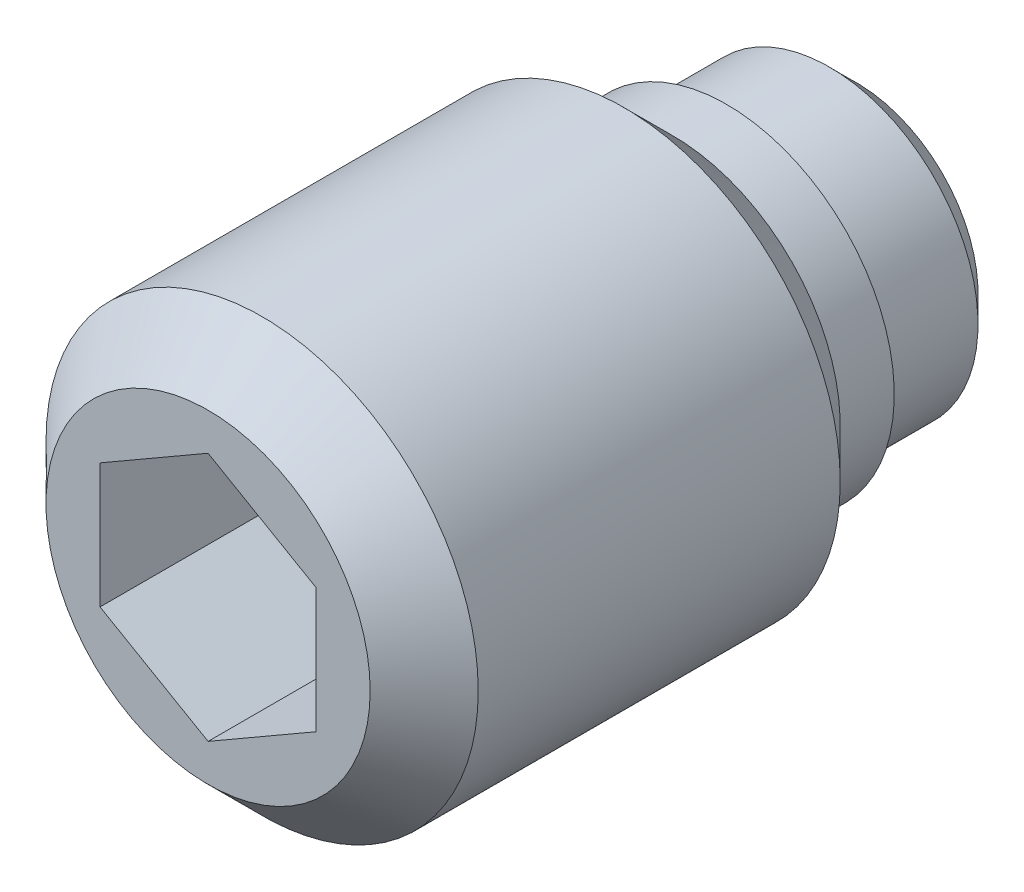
ISO-10303-21;
HEADER;
FILE_DESCRIPTION(('STEP AP214'),'2;1');
FILE_NAME('part.step','',(''),(''),'','','');
FILE_SCHEMA(('AUTOMOTIVE_DESIGN { 1 0 10303 214 1 1 1 1 }'));
ENDSEC;
DATA;
#1=APPLICATION_CONTEXT('core data for automotive mechanical design processes');
#2=APPLICATION_PROTOCOL_DEFINITION('international standard','automotive_design',2000,#1);
#3=PRODUCT_CONTEXT('',#1,'mechanical');
#4=PRODUCT('Part','Part','',(#3));
#5=PRODUCT_RELATED_PRODUCT_CATEGORY('part','',(#4));
#6=PRODUCT_DEFINITION_FORMATION('','',#4);
#7=PRODUCT_DEFINITION_CONTEXT('part definition',#1,'design');
#8=PRODUCT_DEFINITION('design','',#6,#7);
#9=PRODUCT_DEFINITION_SHAPE('','',#8);
#10=(LENGTH_UNIT() NAMED_UNIT(*) SI_UNIT(.MILLI.,.METRE.));
#11=(NAMED_UNIT(*) PLANE_ANGLE_UNIT() SI_UNIT($,.RADIAN.));
#12=(NAMED_UNIT(*) SI_UNIT($,.STERADIAN.) SOLID_ANGLE_UNIT());
#13=UNCERTAINTY_MEASURE_WITH_UNIT(LENGTH_MEASURE(1.E-05),#10,'distance_accuracy_value','');
#14=(GEOMETRIC_REPRESENTATION_CONTEXT(3) GLOBAL_UNCERTAINTY_ASSIGNED_CONTEXT((#13)) GLOBAL_UNIT_ASSIGNED_CONTEXT((#10,
#11,#12)) REPRESENTATION_CONTEXT('',''));
#15=CARTESIAN_POINT('',(0.,0.,0.));
#16=DIRECTION('',(0.,0.,1.));
#17=DIRECTION('',(1.,0.,0.));
#18=AXIS2_PLACEMENT_3D('',#15,#16,#17);
#19=CARTESIAN_POINT('',(0.,0.,2.4));
#20=DIRECTION('',(0.,0.,-1.));
#21=DIRECTION('',(-1.,0.,0.));
#22=AXIS2_PLACEMENT_3D('',#19,#20,#21);
#23=CYLINDRICAL_SURFACE('',#22,4.);
#24=CARTESIAN_POINT('',(0.,0.,4.3));
#25=DIRECTION('',(0.,0.,-1.));
#26=DIRECTION('',(-1.,0.,0.));
#27=AXIS2_PLACEMENT_3D('',#24,#25,#26);
#28=CIRCLE('',#27,4.);
#29=CARTESIAN_POINT('',(-4.,0.,4.3));
#30=VERTEX_POINT('',#29);
#31=EDGE_CURVE('E9',#30,#30,#28,.T.);
#32=ORIENTED_EDGE('',*,*,#31,.F.);
#33=EDGE_LOOP('',(#32));
#34=FACE_BOUND('',#33,.T.);
#35=CARTESIAN_POINT('',(0.,0.,11.));
#36=DIRECTION('',(0.,0.,1.));
#37=DIRECTION('',(1.,0.,0.));
#38=AXIS2_PLACEMENT_3D('',#35,#36,#37);
#39=CIRCLE('',#38,4.);
#40=CARTESIAN_POINT('',(4.,0.,11.));
#41=VERTEX_POINT('',#40);
#42=EDGE_CURVE('E115',#41,#41,#39,.T.);
#43=ORIENTED_EDGE('',*,*,#42,.F.);
#44=EDGE_LOOP('',(#43));
#45=FACE_BOUND('',#44,.T.);
#46=ADVANCED_FACE('F14',(#34,#45),#23,.T.);
#47=CARTESIAN_POINT('',(0.,0.,4.3));
#48=DIRECTION('',(0.,0.,1.));
#49=DIRECTION('',(1.,0.,0.));
#50=AXIS2_PLACEMENT_3D('',#47,#48,#49);
#51=CONICAL_SURFACE('',#50,4.,0.785398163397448);
#52=ORIENTED_EDGE('',*,*,#31,.T.);
#53=EDGE_LOOP('',(#52));
#54=FACE_BOUND('',#53,.T.);
#55=CARTESIAN_POINT('',(0.,0.,3.4));
#56=DIRECTION('',(0.,0.,-1.));
#57=DIRECTION('',(-1.,0.,0.));
#58=AXIS2_PLACEMENT_3D('',#55,#56,#57);
#59=CIRCLE('',#58,3.1);
#60=CARTESIAN_POINT('',(-3.1,0.,3.4));
#61=VERTEX_POINT('',#60);
#62=EDGE_CURVE('E21',#61,#61,#59,.T.);
#63=ORIENTED_EDGE('',*,*,#62,.F.);
#64=EDGE_LOOP('',(#63));
#65=FACE_BOUND('',#64,.T.);
#66=ADVANCED_FACE('F143',(#54,#65),#51,.T.);
#67=CARTESIAN_POINT('',(0.,0.,2.4));
#68=DIRECTION('',(0.,0.,-1.));
#69=DIRECTION('',(-1.,0.,0.));
#70=AXIS2_PLACEMENT_3D('',#67,#68,#69);
#71=CYLINDRICAL_SURFACE('',#70,3.1);
#72=ORIENTED_EDGE('',*,*,#62,.T.);
#73=EDGE_LOOP('',(#72));
#74=FACE_BOUND('',#73,.T.);
#75=CARTESIAN_POINT('',(0.,0.,2.4));
#76=DIRECTION('',(0.,0.,-1.));
#77=DIRECTION('',(-1.,0.,0.));
#78=AXIS2_PLACEMENT_3D('',#75,#76,#77);
#79=CIRCLE('',#78,3.1);
#80=CARTESIAN_POINT('',(-3.1,0.,2.4));
#81=VERTEX_POINT('',#80);
#82=EDGE_CURVE('E135',#81,#81,#79,.T.);
#83=ORIENTED_EDGE('',*,*,#82,.F.);
#84=EDGE_LOOP('',(#83));
#85=FACE_BOUND('',#84,.T.);
#86=ADVANCED_FACE('F140',(#74,#85),#71,.T.);
#87=CARTESIAN_POINT('',(0.,3.1,2.4));
#88=DIRECTION('',(0.,0.,1.));
#89=DIRECTION('',(1.,0.,0.));
#90=AXIS2_PLACEMENT_3D('',#87,#88,#89);
#91=PLANE('',#90);
#92=ORIENTED_EDGE('',*,*,#82,.T.);
#93=EDGE_LOOP('',(#92));
#94=FACE_BOUND('',#93,.T.);
#95=CARTESIAN_POINT('',(0.,0.,2.4));
#96=DIRECTION('',(0.,0.,-1.));
#97=DIRECTION('',(-1.,0.,0.));
#98=AXIS2_PLACEMENT_3D('',#95,#96,#97);
#99=CIRCLE('',#98,2.75);
#100=CARTESIAN_POINT('',(-2.75,0.,2.4));
#101=VERTEX_POINT('',#100);
#102=EDGE_CURVE('E132',#101,#101,#99,.T.);
#103=ORIENTED_EDGE('',*,*,#102,.F.);
#104=EDGE_LOOP('',(#103));
#105=FACE_BOUND('',#104,.T.);
#106=ADVANCED_FACE('F151',(#94,#105),#91,.F.);
#107=CARTESIAN_POINT('',(0.,0.,0.));
#108=DIRECTION('',(0.,0.,-1.));
#109=DIRECTION('',(-1.,0.,0.));
#110=AXIS2_PLACEMENT_3D('',#107,#108,#109);
#111=CYLINDRICAL_SURFACE('',#110,2.75);
#112=CARTESIAN_POINT('',(0.,0.,0.5));
#113=DIRECTION('',(0.,0.,-1.));
#114=DIRECTION('',(-1.,0.,0.));
#115=AXIS2_PLACEMENT_3D('',#112,#113,#114);
#116=CIRCLE('',#115,2.75);
#117=CARTESIAN_POINT('',(-2.75,0.,0.5));
#118=VERTEX_POINT('',#117);
#119=EDGE_CURVE('E129',#118,#118,#116,.T.);
#120=ORIENTED_EDGE('',*,*,#119,.F.);
#121=EDGE_LOOP('',(#120));
#122=FACE_BOUND('',#121,.T.);
#123=ORIENTED_EDGE('',*,*,#102,.T.);
#124=EDGE_LOOP('',(#123));
#125=FACE_BOUND('',#124,.T.);
#126=ADVANCED_FACE('F157',(#122,#125),#111,.T.);
#127=CARTESIAN_POINT('',(0.,0.,0.5));
#128=DIRECTION('',(0.,0.,1.));
#129=DIRECTION('',(1.,0.,0.));
#130=AXIS2_PLACEMENT_3D('',#127,#128,#129);
#131=CONICAL_SURFACE('',#130,2.75,0.785398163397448);
#132=CARTESIAN_POINT('',(0.,0.,0.));
#133=DIRECTION('',(0.,0.,-1.));
#134=DIRECTION('',(-1.,0.,0.));
#135=AXIS2_PLACEMENT_3D('',#132,#133,#134);
#136=CIRCLE('',#135,2.25);
#137=CARTESIAN_POINT('',(-2.25,0.,0.));
#138=VERTEX_POINT('',#137);
#139=EDGE_CURVE('E126',#138,#138,#136,.T.);
#140=ORIENTED_EDGE('',*,*,#139,.F.);
#141=EDGE_LOOP('',(#140));
#142=FACE_BOUND('',#141,.T.);
#143=ORIENTED_EDGE('',*,*,#119,.T.);
#144=EDGE_LOOP('',(#143));
#145=FACE_BOUND('',#144,.T.);
#146=ADVANCED_FACE('F161',(#142,#145),#131,.T.);
#147=CARTESIAN_POINT('',(0.,2.25,0.));
#148=DIRECTION('',(0.,0.,1.));
#149=DIRECTION('',(1.,0.,0.));
#150=AXIS2_PLACEMENT_3D('',#147,#148,#149);
#151=PLANE('',#150);
#152=ORIENTED_EDGE('',*,*,#139,.T.);
#153=EDGE_LOOP('',(#152));
#154=FACE_BOUND('',#153,.T.);
#155=ADVANCED_FACE('F165',(#154),#151,.F.);
#156=CARTESIAN_POINT('',(0.,0.,12.));
#157=DIRECTION('',(0.,0.,1.));
#158=DIRECTION('',(1.,0.,0.));
#159=AXIS2_PLACEMENT_3D('',#156,#157,#158);
#160=PLANE('',#159);
#161=DIRECTION('',(0.866025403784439,-0.5,0.));
#162=VECTOR('',#161,1.);
#163=CARTESIAN_POINT('',(-2.,-1.15470053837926,12.));
#164=LINE('',#163,#162);
#165=CARTESIAN_POINT('',(-2.,-1.15470053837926,12.));
#166=VERTEX_POINT('',#165);
#167=CARTESIAN_POINT('',(0.,-2.30940107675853,12.));
#168=VERTEX_POINT('',#167);
#169=EDGE_CURVE('E28',#166,#168,#164,.T.);
#170=ORIENTED_EDGE('',*,*,#169,.F.);
#171=DIRECTION('',(0.,-1.,0.));
#172=VECTOR('',#171,1.);
#173=CARTESIAN_POINT('',(-2.,1.15470053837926,12.));
#174=LINE('',#173,#172);
#175=CARTESIAN_POINT('',(-2.,1.15470053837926,12.));
#176=VERTEX_POINT('',#175);
#177=EDGE_CURVE('E111',#176,#166,#174,.T.);
#178=ORIENTED_EDGE('',*,*,#177,.F.);
#179=DIRECTION('',(-0.866025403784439,-0.5,0.));
#180=VECTOR('',#179,1.);
#181=CARTESIAN_POINT('',(0.,2.30940107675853,12.));
#182=LINE('',#181,#180);
#183=CARTESIAN_POINT('',(0.,2.30940107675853,12.));
#184=VERTEX_POINT('',#183);
#185=EDGE_CURVE('E109',#184,#176,#182,.T.);
#186=ORIENTED_EDGE('',*,*,#185,.F.);
#187=DIRECTION('',(-0.866025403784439,0.5,0.));
#188=VECTOR('',#187,1.);
#189=CARTESIAN_POINT('',(2.,1.15470053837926,12.));
#190=LINE('',#189,#188);
#191=CARTESIAN_POINT('',(2.,1.15470053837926,12.));
#192=VERTEX_POINT('',#191);
#193=EDGE_CURVE('E76',#192,#184,#190,.T.);
#194=ORIENTED_EDGE('',*,*,#193,.F.);
#195=DIRECTION('',(0.,1.,0.));
#196=VECTOR('',#195,1.);
#197=CARTESIAN_POINT('',(2.,-1.15470053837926,12.));
#198=LINE('',#197,#196);
#199=CARTESIAN_POINT('',(2.,-1.15470053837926,12.));
#200=VERTEX_POINT('',#199);
#201=EDGE_CURVE('E105',#200,#192,#198,.T.);
#202=ORIENTED_EDGE('',*,*,#201,.F.);
#203=DIRECTION('',(0.866025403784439,0.5,0.));
#204=VECTOR('',#203,1.);
#205=CARTESIAN_POINT('',(0.,-2.30940107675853,12.));
#206=LINE('',#205,#204);
#207=EDGE_CURVE('E102',#168,#200,#206,.T.);
#208=ORIENTED_EDGE('',*,*,#207,.F.);
#209=EDGE_LOOP('',(#170,#178,#186,#194,#202,#208));
#210=FACE_BOUND('',#209,.T.);
#211=CARTESIAN_POINT('',(0.,0.,12.));
#212=DIRECTION('',(0.,0.,1.));
#213=DIRECTION('',(1.,0.,0.));
#214=AXIS2_PLACEMENT_3D('',#211,#212,#213);
#215=CIRCLE('',#214,3.);
#216=CARTESIAN_POINT('',(3.,0.,12.));
#217=VERTEX_POINT('',#216);
#218=EDGE_CURVE('E123',#217,#217,#215,.T.);
#219=ORIENTED_EDGE('',*,*,#218,.T.);
#220=EDGE_LOOP('',(#219));
#221=FACE_BOUND('',#220,.T.);
#222=ADVANCED_FACE('F169',(#210,#221),#160,.T.);
#223=CARTESIAN_POINT('',(0.,0.,12.));
#224=DIRECTION('',(0.,0.,-1.));
#225=DIRECTION('',(-1.,0.,0.));
#226=AXIS2_PLACEMENT_3D('',#223,#224,#225);
#227=CONICAL_SURFACE('',#226,3.,0.785398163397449);
#228=ORIENTED_EDGE('',*,*,#42,.T.);
#229=EDGE_LOOP('',(#228));
#230=FACE_BOUND('',#229,.T.);
#231=ORIENTED_EDGE('',*,*,#218,.F.);
#232=EDGE_LOOP('',(#231));
#233=FACE_BOUND('',#232,.T.);
#234=ADVANCED_FACE('F173',(#230,#233),#227,.T.);
#235=CARTESIAN_POINT('',(-2.,-1.15470053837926,9.));
#236=DIRECTION('',(-0.5,-0.866025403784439,0.));
#237=DIRECTION('',(0.866025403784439,-0.5,0.));
#238=AXIS2_PLACEMENT_3D('',#235,#236,#237);
#239=PLANE('',#238);
#240=ORIENTED_EDGE('',*,*,#169,.T.);
#241=DIRECTION('',(0.,0.,1.));
#242=VECTOR('',#241,1.);
#243=CARTESIAN_POINT('',(0.,-2.30940107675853,9.));
#244=LINE('',#243,#242);
#245=CARTESIAN_POINT('',(0.,-2.30940107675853,9.));
#246=VERTEX_POINT('',#245);
#247=EDGE_CURVE('E58',#246,#168,#244,.T.);
#248=ORIENTED_EDGE('',*,*,#247,.F.);
#249=DIRECTION('',(0.866025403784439,-0.5,0.));
#250=VECTOR('',#249,1.);
#251=CARTESIAN_POINT('',(-2.,-1.15470053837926,9.));
#252=LINE('',#251,#250);
#253=CARTESIAN_POINT('',(-2.,-1.15470053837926,9.));
#254=VERTEX_POINT('',#253);
#255=EDGE_CURVE('E113',#254,#246,#252,.T.);
#256=ORIENTED_EDGE('',*,*,#255,.F.);
#257=DIRECTION('',(0.,0.,1.));
#258=VECTOR('',#257,1.);
#259=CARTESIAN_POINT('',(-2.,-1.15470053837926,9.));
#260=LINE('',#259,#258);
#261=EDGE_CURVE('E36',#254,#166,#260,.T.);
#262=ORIENTED_EDGE('',*,*,#261,.T.);
#263=EDGE_LOOP('',(#240,#248,#256,#262));
#264=FACE_BOUND('',#263,.T.);
#265=ADVANCED_FACE('F177',(#264),#239,.F.);
#266=CARTESIAN_POINT('',(-2.,1.15470053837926,9.));
#267=DIRECTION('',(-1.,0.,0.));
#268=DIRECTION('',(0.,0.,1.));
#269=AXIS2_PLACEMENT_3D('',#266,#267,#268);
#270=PLANE('',#269);
#271=ORIENTED_EDGE('',*,*,#177,.T.);
#272=ORIENTED_EDGE('',*,*,#261,.F.);
#273=DIRECTION('',(0.,-1.,0.));
#274=VECTOR('',#273,1.);
#275=CARTESIAN_POINT('',(-2.,1.15470053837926,9.));
#276=LINE('',#275,#274);
#277=CARTESIAN_POINT('',(-2.,1.15470053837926,9.));
#278=VERTEX_POINT('',#277);
#279=EDGE_CURVE('E88',#278,#254,#276,.T.);
#280=ORIENTED_EDGE('',*,*,#279,.F.);
#281=DIRECTION('',(0.,0.,1.));
#282=VECTOR('',#281,1.);
#283=CARTESIAN_POINT('',(-2.,1.15470053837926,9.));
#284=LINE('',#283,#282);
#285=EDGE_CURVE('E80',#278,#176,#284,.T.);
#286=ORIENTED_EDGE('',*,*,#285,.T.);
#287=EDGE_LOOP('',(#271,#272,#280,#286));
#288=FACE_BOUND('',#287,.T.);
#289=ADVANCED_FACE('F181',(#288),#270,.F.);
#290=CARTESIAN_POINT('',(0.,2.30940107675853,9.));
#291=DIRECTION('',(-0.5,0.866025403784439,0.));
#292=DIRECTION('',(-0.866025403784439,-0.5,0.));
#293=AXIS2_PLACEMENT_3D('',#290,#291,#292);
#294=PLANE('',#293);
#295=ORIENTED_EDGE('',*,*,#185,.T.);
#296=ORIENTED_EDGE('',*,*,#285,.F.);
#297=DIRECTION('',(-0.866025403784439,-0.5,0.));
#298=VECTOR('',#297,1.);
#299=CARTESIAN_POINT('',(0.,2.30940107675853,9.));
#300=LINE('',#299,#298);
#301=CARTESIAN_POINT('',(0.,2.30940107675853,9.));
#302=VERTEX_POINT('',#301);
#303=EDGE_CURVE('E84',#302,#278,#300,.T.);
#304=ORIENTED_EDGE('',*,*,#303,.F.);
#305=DIRECTION('',(0.,0.,1.));
#306=VECTOR('',#305,1.);
#307=CARTESIAN_POINT('',(0.,2.30940107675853,9.));
#308=LINE('',#307,#306);
#309=EDGE_CURVE('E69',#302,#184,#308,.T.);
#310=ORIENTED_EDGE('',*,*,#309,.T.);
#311=EDGE_LOOP('',(#295,#296,#304,#310));
#312=FACE_BOUND('',#311,.T.);
#313=ADVANCED_FACE('F85',(#312),#294,.F.);
#314=CARTESIAN_POINT('',(2.,1.15470053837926,9.));
#315=DIRECTION('',(0.5,0.866025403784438,0.));
#316=DIRECTION('',(-0.866025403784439,0.5,0.));
#317=AXIS2_PLACEMENT_3D('',#314,#315,#316);
#318=PLANE('',#317);
#319=ORIENTED_EDGE('',*,*,#193,.T.);
#320=ORIENTED_EDGE('',*,*,#309,.F.);
#321=DIRECTION('',(-0.866025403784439,0.5,0.));
#322=VECTOR('',#321,1.);
#323=CARTESIAN_POINT('',(2.,1.15470053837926,9.));
#324=LINE('',#323,#322);
#325=CARTESIAN_POINT('',(2.,1.15470053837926,9.));
#326=VERTEX_POINT('',#325);
#327=EDGE_CURVE('E73',#326,#302,#324,.T.);
#328=ORIENTED_EDGE('',*,*,#327,.F.);
#329=DIRECTION('',(0.,0.,1.));
#330=VECTOR('',#329,1.);
#331=CARTESIAN_POINT('',(2.,1.15470053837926,9.));
#332=LINE('',#331,#330);
#333=EDGE_CURVE('E81',#326,#192,#332,.T.);
#334=ORIENTED_EDGE('',*,*,#333,.T.);
#335=EDGE_LOOP('',(#319,#320,#328,#334));
#336=FACE_BOUND('',#335,.T.);
#337=ADVANCED_FACE('F71',(#336),#318,.F.);
#338=CARTESIAN_POINT('',(2.,-1.15470053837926,9.));
#339=DIRECTION('',(1.,0.,0.));
#340=DIRECTION('',(0.,0.,-1.));
#341=AXIS2_PLACEMENT_3D('',#338,#339,#340);
#342=PLANE('',#341);
#343=ORIENTED_EDGE('',*,*,#201,.T.);
#344=ORIENTED_EDGE('',*,*,#333,.F.);
#345=DIRECTION('',(0.,1.,0.));
#346=VECTOR('',#345,1.);
#347=CARTESIAN_POINT('',(2.,-1.15470053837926,9.));
#348=LINE('',#347,#346);
#349=CARTESIAN_POINT('',(2.,-1.15470053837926,9.));
#350=VERTEX_POINT('',#349);
#351=EDGE_CURVE('E94',#350,#326,#348,.T.);
#352=ORIENTED_EDGE('',*,*,#351,.F.);
#353=DIRECTION('',(0.,0.,1.));
#354=VECTOR('',#353,1.);
#355=CARTESIAN_POINT('',(2.,-1.15470053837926,9.));
#356=LINE('',#355,#354);
#357=EDGE_CURVE('E118',#350,#200,#356,.T.);
#358=ORIENTED_EDGE('',*,*,#357,.T.);
#359=EDGE_LOOP('',(#343,#344,#352,#358));
#360=FACE_BOUND('',#359,.T.);
#361=ADVANCED_FACE('F185',(#360),#342,.F.);
#362=CARTESIAN_POINT('',(0.,-2.30940107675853,9.));
#363=DIRECTION('',(0.5,-0.866025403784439,0.));
#364=DIRECTION('',(0.866025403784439,0.5,0.));
#365=AXIS2_PLACEMENT_3D('',#362,#363,#364);
#366=PLANE('',#365);
#367=ORIENTED_EDGE('',*,*,#207,.T.);
#368=ORIENTED_EDGE('',*,*,#357,.F.);
#369=DIRECTION('',(0.866025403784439,0.5,0.));
#370=VECTOR('',#369,1.);
#371=CARTESIAN_POINT('',(0.,-2.30940107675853,9.));
#372=LINE('',#371,#370);
#373=EDGE_CURVE('E96',#246,#350,#372,.T.);
#374=ORIENTED_EDGE('',*,*,#373,.F.);
#375=ORIENTED_EDGE('',*,*,#247,.T.);
#376=EDGE_LOOP('',(#367,#368,#374,#375));
#377=FACE_BOUND('',#376,.T.);
#378=ADVANCED_FACE('F182',(#377),#366,.F.);
#379=CARTESIAN_POINT('',(0.,0.,9.));
#380=DIRECTION('',(0.,0.,1.));
#381=DIRECTION('',(1.,0.,0.));
#382=AXIS2_PLACEMENT_3D('',#379,#380,#381);
#383=PLANE('',#382);
#384=ORIENTED_EDGE('',*,*,#255,.T.);
#385=ORIENTED_EDGE('',*,*,#373,.T.);
#386=ORIENTED_EDGE('',*,*,#351,.T.);
#387=ORIENTED_EDGE('',*,*,#327,.T.);
#388=ORIENTED_EDGE('',*,*,#303,.T.);
#389=ORIENTED_EDGE('',*,*,#279,.T.);
#390=EDGE_LOOP('',(#384,#385,#386,#387,#388,#389));
#391=FACE_BOUND('',#390,.T.);
#392=ADVANCED_FACE('F91',(#391),#383,.T.);
#393=CLOSED_SHELL('',(#46,#66,#86,#106,#126,#146,#155,#222,#234,#265,#289,#313,#337,#361,#378,#392));
#394=MANIFOLD_SOLID_BREP('B1',#393);
#395=ADVANCED_BREP_SHAPE_REPRESENTATION('',(#18,#394),#14);
#396=SHAPE_DEFINITION_REPRESENTATION(#9,#395);
ENDSEC;
END-ISO-10303-21;
